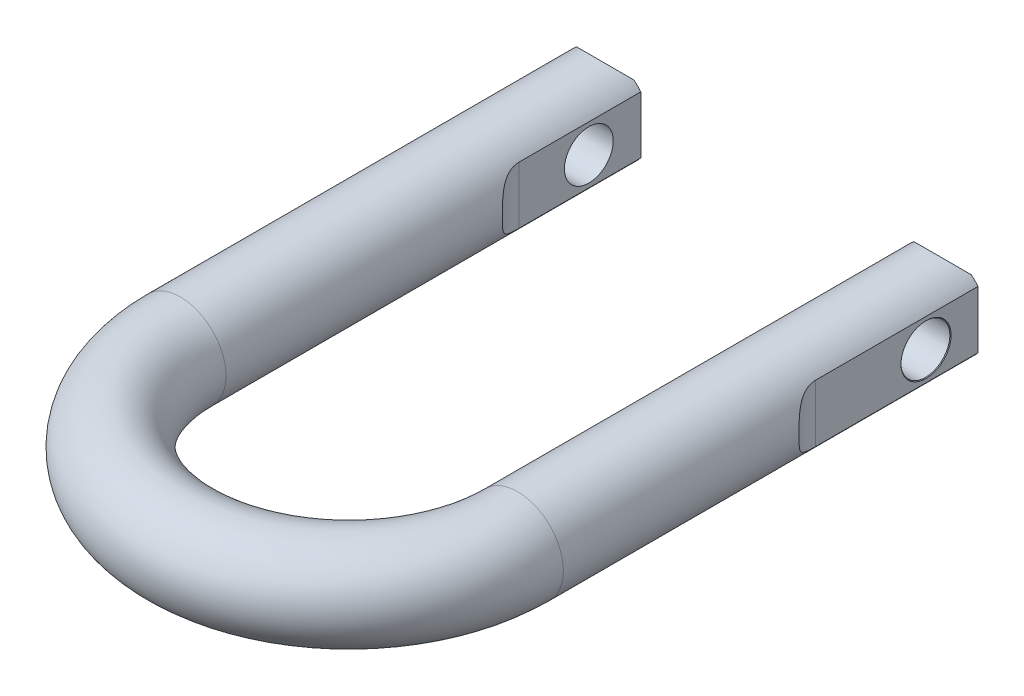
ISO-10303-21;
HEADER;
FILE_DESCRIPTION(('STEP AP214'),'2;1');
FILE_NAME('part.step','',(''),(''),'','','');
FILE_SCHEMA(('AUTOMOTIVE_DESIGN { 1 0 10303 214 1 1 1 1 }'));
ENDSEC;
DATA;
#1=APPLICATION_CONTEXT('core data for automotive mechanical design processes');
#2=APPLICATION_PROTOCOL_DEFINITION('international standard','automotive_design',2000,#1);
#3=PRODUCT_CONTEXT('',#1,'mechanical');
#4=PRODUCT('Part','Part','',(#3));
#5=PRODUCT_RELATED_PRODUCT_CATEGORY('part','',(#4));
#6=PRODUCT_DEFINITION_FORMATION('','',#4);
#7=PRODUCT_DEFINITION_CONTEXT('part definition',#1,'design');
#8=PRODUCT_DEFINITION('design','',#6,#7);
#9=PRODUCT_DEFINITION_SHAPE('','',#8);
#10=(LENGTH_UNIT() NAMED_UNIT(*) SI_UNIT(.MILLI.,.METRE.));
#11=(NAMED_UNIT(*) PLANE_ANGLE_UNIT() SI_UNIT($,.RADIAN.));
#12=(NAMED_UNIT(*) SI_UNIT($,.STERADIAN.) SOLID_ANGLE_UNIT());
#13=UNCERTAINTY_MEASURE_WITH_UNIT(LENGTH_MEASURE(1.E-05),#10,'distance_accuracy_value','');
#14=(GEOMETRIC_REPRESENTATION_CONTEXT(3) GLOBAL_UNCERTAINTY_ASSIGNED_CONTEXT((#13)) GLOBAL_UNIT_ASSIGNED_CONTEXT((#10,
#11,#12)) REPRESENTATION_CONTEXT('',''));
#15=CARTESIAN_POINT('',(0.,0.,0.));
#16=DIRECTION('',(0.,0.,1.));
#17=DIRECTION('',(1.,0.,0.));
#18=AXIS2_PLACEMENT_3D('',#15,#16,#17);
#19=CARTESIAN_POINT('',(127.36576,0.,0.));
#20=DIRECTION('',(-1.,0.,0.));
#21=DIRECTION('',(0.,-1.,0.));
#22=AXIS2_PLACEMENT_3D('',#19,#20,#21);
#23=CYLINDRICAL_SURFACE('',#22,15.2781);
#24=CARTESIAN_POINT('',(83.312,0.,0.));
#25=DIRECTION('',(-1.,0.,0.));
#26=DIRECTION('',(0.,-1.,0.));
#27=AXIS2_PLACEMENT_3D('',#24,#25,#26);
#28=CIRCLE('',#27,15.2781);
#29=CARTESIAN_POINT('',(83.312,-15.2781,0.));
#30=VERTEX_POINT('',#29);
#31=EDGE_CURVE('E18',#30,#30,#28,.T.);
#32=ORIENTED_EDGE('',*,*,#31,.T.);
#33=EDGE_LOOP('',(#32));
#34=FACE_BOUND('',#33,.T.);
#35=CARTESIAN_POINT('',(127.36576,0.,0.));
#36=DIRECTION('',(-1.,0.,0.));
#37=DIRECTION('',(0.,-1.,0.));
#38=AXIS2_PLACEMENT_3D('',#35,#36,#37);
#39=CIRCLE('',#38,15.2781);
#40=CARTESIAN_POINT('',(127.36576,-15.2781,0.));
#41=VERTEX_POINT('',#40);
#42=EDGE_CURVE('E173',#41,#41,#39,.F.);
#43=ORIENTED_EDGE('',*,*,#42,.T.);
#44=EDGE_LOOP('',(#43));
#45=FACE_BOUND('',#44,.T.);
#46=ADVANCED_FACE('F14',(#34,#45),#23,.F.);
#47=CARTESIAN_POINT('',(127.36576,0.,0.));
#48=DIRECTION('',(1.,0.,0.));
#49=DIRECTION('',(0.,1.,0.));
#50=AXIS2_PLACEMENT_3D('',#47,#48,#49);
#51=CONICAL_SURFACE('',#50,15.2781,0.785398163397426);
#52=CARTESIAN_POINT('',(127.762000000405,0.,0.));
#53=DIRECTION('',(-1.,0.,0.));
#54=DIRECTION('',(0.,0.,1.));
#55=AXIS2_PLACEMENT_3D('',#52,#53,#54);
#56=CIRCLE('',#55,15.6743400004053);
#57=CARTESIAN_POINT('',(127.762000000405,0.,15.6743400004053));
#58=VERTEX_POINT('',#57);
#59=EDGE_CURVE('E275',#58,#58,#56,.T.);
#60=ORIENTED_EDGE('',*,*,#59,.F.);
#61=EDGE_LOOP('',(#60));
#62=FACE_BOUND('',#61,.T.);
#63=ORIENTED_EDGE('',*,*,#42,.F.);
#64=EDGE_LOOP('',(#63));
#65=FACE_BOUND('',#64,.T.);
#66=ADVANCED_FACE('F247',(#62,#65),#51,.F.);
#67=CARTESIAN_POINT('',(-83.312,0.,0.));
#68=DIRECTION('',(-1.,0.,0.));
#69=DIRECTION('',(0.,-1.,0.));
#70=AXIS2_PLACEMENT_3D('',#67,#68,#69);
#71=CYLINDRICAL_SURFACE('',#70,15.2781);
#72=CARTESIAN_POINT('',(-83.312,0.,0.));
#73=DIRECTION('',(-1.,0.,0.));
#74=DIRECTION('',(0.,-1.,0.));
#75=AXIS2_PLACEMENT_3D('',#72,#73,#74);
#76=CIRCLE('',#75,15.2781);
#77=CARTESIAN_POINT('',(-83.312,-15.2781,0.));
#78=VERTEX_POINT('',#77);
#79=EDGE_CURVE('E129',#78,#78,#76,.F.);
#80=ORIENTED_EDGE('',*,*,#79,.T.);
#81=EDGE_LOOP('',(#80));
#82=FACE_BOUND('',#81,.T.);
#83=CARTESIAN_POINT('',(-127.36576,0.,0.));
#84=DIRECTION('',(-1.,0.,0.));
#85=DIRECTION('',(0.,-1.,0.));
#86=AXIS2_PLACEMENT_3D('',#83,#84,#85);
#87=CIRCLE('',#86,15.2781);
#88=CARTESIAN_POINT('',(-127.36576,-15.2781,0.));
#89=VERTEX_POINT('',#88);
#90=EDGE_CURVE('E161',#89,#89,#87,.F.);
#91=ORIENTED_EDGE('',*,*,#90,.F.);
#92=EDGE_LOOP('',(#91));
#93=FACE_BOUND('',#92,.T.);
#94=ADVANCED_FACE('F254',(#82,#93),#71,.F.);
#95=CARTESIAN_POINT('',(-127.36576,0.,0.));
#96=DIRECTION('',(-1.,0.,0.));
#97=DIRECTION('',(0.,-1.,0.));
#98=AXIS2_PLACEMENT_3D('',#95,#96,#97);
#99=CONICAL_SURFACE('',#98,15.2781,0.785398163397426);
#100=CARTESIAN_POINT('',(-127.762000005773,0.,0.));
#101=DIRECTION('',(1.,0.,0.));
#102=DIRECTION('',(0.,0.,-1.));
#103=AXIS2_PLACEMENT_3D('',#100,#101,#102);
#104=CIRCLE('',#103,15.6743400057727);
#105=CARTESIAN_POINT('',(-127.762000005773,0.,-15.6743400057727));
#106=VERTEX_POINT('',#105);
#107=EDGE_CURVE('E176',#106,#106,#104,.T.);
#108=ORIENTED_EDGE('',*,*,#107,.F.);
#109=EDGE_LOOP('',(#108));
#110=FACE_BOUND('',#109,.T.);
#111=ORIENTED_EDGE('',*,*,#90,.T.);
#112=EDGE_LOOP('',(#111));
#113=FACE_BOUND('',#112,.T.);
#114=ADVANCED_FACE('F227',(#110,#113),#99,.F.);
#115=CARTESIAN_POINT('',(123.7447884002,22.225,-32.512));
#116=DIRECTION('',(0.,-0.707106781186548,0.707106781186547));
#117=DIRECTION('',(0.,0.707106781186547,0.707106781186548));
#118=AXIS2_PLACEMENT_3D('',#115,#116,#117);
#119=PLANE('',#118);
#120=DIRECTION('',(1.,0.,0.));
#121=VECTOR('',#120,1.);
#122=CARTESIAN_POINT('',(105.537,22.225,-32.512));
#123=LINE('',#122,#121);
#124=CARTESIAN_POINT('',(87.6082377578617,22.225,-32.512));
#125=VERTEX_POINT('',#124);
#126=CARTESIAN_POINT('',(123.529262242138,22.225,-32.512));
#127=VERTEX_POINT('',#126);
#128=EDGE_CURVE('E101',#125,#127,#123,.T.);
#129=ORIENTED_EDGE('',*,*,#128,.F.);
#130=CARTESIAN_POINT('',(105.56875,0.,-54.737));
#131=DIRECTION('',(0.,-0.707106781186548,0.707106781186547));
#132=DIRECTION('',(0.,-0.707106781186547,-0.707106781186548));
#133=AXIS2_PLACEMENT_3D('',#130,#131,#132);
#134=ELLIPSE('',#133,40.4111525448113,28.575);
#135=EDGE_CURVE('E105',#125,#127,#134,.F.);
#136=ORIENTED_EDGE('',*,*,#135,.T.);
#137=EDGE_LOOP('',(#129,#136));
#138=FACE_BOUND('',#137,.T.);
#139=ADVANCED_FACE('F103',(#138),#119,.F.);
#140=CARTESIAN_POINT('',(153.162,-18.2157267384,69.088));
#141=DIRECTION('',(0.,1.,0.));
#142=DIRECTION('',(-1.,0.,0.));
#143=AXIS2_PLACEMENT_3D('',#140,#141,#142);
#144=CYLINDRICAL_SURFACE('',#143,25.4);
#145=CARTESIAN_POINT('',(127.76200000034,17.9997299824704,69.0879999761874));
#146=CARTESIAN_POINT('',(127.761997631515,17.9997270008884,69.3125340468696));
#147=CARTESIAN_POINT('',(127.764978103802,17.9960588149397,69.5370409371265));
#148=CARTESIAN_POINT('',(127.776875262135,17.9813771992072,69.9856525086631));
#149=CARTESIAN_POINT('',(127.785791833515,17.9703639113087,70.2097571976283));
#150=CARTESIAN_POINT('',(127.821397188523,17.9262894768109,70.8808747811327));
#151=CARTESIAN_POINT('',(127.856941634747,17.8821937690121,71.3267762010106));
#152=CARTESIAN_POINT('',(127.950918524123,17.7644249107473,72.2120230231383));
#153=CARTESIAN_POINT('',(128.009344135,17.6907605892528,72.651370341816));
#154=CARTESIAN_POINT('',(128.147878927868,17.5136004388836,73.520534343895));
#155=CARTESIAN_POINT('',(128.22798741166,17.4101055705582,73.9503513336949));
#156=CARTESIAN_POINT('',(128.408285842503,17.1728979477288,74.7977729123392));
#157=CARTESIAN_POINT('',(128.50849750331,17.0391524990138,75.2153637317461));
#158=CARTESIAN_POINT('',(128.726737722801,16.7413345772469,76.0347776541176));
#159=CARTESIAN_POINT('',(128.844766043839,16.5772625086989,76.4366009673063));
#160=CARTESIAN_POINT('',(129.095861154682,16.2189230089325,77.2212993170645));
#161=CARTESIAN_POINT('',(129.228917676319,16.0246761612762,77.6041870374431));
#162=CARTESIAN_POINT('',(129.50700729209,15.6062017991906,78.3486269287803));
#163=CARTESIAN_POINT('',(129.652040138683,15.3819749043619,78.7101795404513));
#164=CARTESIAN_POINT('',(129.948202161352,14.9080421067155,79.40398744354));
#165=CARTESIAN_POINT('',(130.099195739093,14.6588040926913,79.7366204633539));
#166=CARTESIAN_POINT('',(130.405875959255,14.1329545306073,80.3771508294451));
#167=CARTESIAN_POINT('',(130.561562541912,13.856343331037,80.6850484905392));
#168=CARTESIAN_POINT('',(130.874028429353,13.2771146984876,81.2747849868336));
#169=CARTESIAN_POINT('',(131.030807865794,12.9744940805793,81.5566206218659));
#170=CARTESIAN_POINT('',(131.341873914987,12.3450368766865,82.0933195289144));
#171=CARTESIAN_POINT('',(131.49616048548,12.0181998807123,82.3481823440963));
#172=CARTESIAN_POINT('',(131.801147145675,11.3372491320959,82.8341828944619));
#173=CARTESIAN_POINT('',(131.951757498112,10.9827971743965,83.0649027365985));
#174=CARTESIAN_POINT('',(132.243679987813,10.2534400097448,83.498140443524));
#175=CARTESIAN_POINT('',(132.38499199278,9.87853451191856,83.7006579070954));
#176=CARTESIAN_POINT('',(132.655560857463,9.11049899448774,84.0779938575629));
#177=CARTESIAN_POINT('',(132.78480866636,8.71735561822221,84.2527916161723));
#178=CARTESIAN_POINT('',(133.028688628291,7.91567837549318,84.5751115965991));
#179=CARTESIAN_POINT('',(133.143320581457,7.50714429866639,84.7226334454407));
#180=CARTESIAN_POINT('',(133.363630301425,6.64726701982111,85.0008348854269));
#181=CARTESIAN_POINT('',(133.46806429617,6.19496244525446,85.1295298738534));
#182=CARTESIAN_POINT('',(133.655856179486,5.27862558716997,85.3573624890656));
#183=CARTESIAN_POINT('',(133.739210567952,4.81459137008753,85.4564952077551));
#184=CARTESIAN_POINT('',(133.883243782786,3.87864924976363,85.6258926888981));
#185=CARTESIAN_POINT('',(133.943959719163,3.40675556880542,85.6962047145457));
#186=CARTESIAN_POINT('',(134.041883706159,2.45740250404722,85.8088479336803));
#187=CARTESIAN_POINT('',(134.079102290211,1.97994571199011,85.8511916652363));
#188=CARTESIAN_POINT('',(134.117429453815,1.25144697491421,85.8946850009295));
#189=CARTESIAN_POINT('',(134.12729504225,1.00139567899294,85.9058509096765));
#190=CARTESIAN_POINT('',(134.140456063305,0.500905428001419,85.9207348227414));
#191=CARTESIAN_POINT('',(134.143751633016,0.250466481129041,85.9244529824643));
#192=CARTESIAN_POINT('',(134.143746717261,-0.503635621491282,85.9244545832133));
#193=CARTESIAN_POINT('',(134.1304119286,-1.00738260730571,85.9094242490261));
#194=CARTESIAN_POINT('',(134.07727904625,-2.01185607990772,85.849115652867));
#195=CARTESIAN_POINT('',(134.03746789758,-2.51258095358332,85.8038224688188));
#196=CARTESIAN_POINT('',(133.931957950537,-3.50860707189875,85.6823357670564));
#197=CARTESIAN_POINT('',(133.866205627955,-4.00389491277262,85.6060783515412));
#198=CARTESIAN_POINT('',(133.710027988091,-4.98453363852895,85.4218713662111));
#199=CARTESIAN_POINT('',(133.619605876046,-5.46988580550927,85.3139259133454));
#200=CARTESIAN_POINT('',(133.415659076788,-6.42811293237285,85.0651065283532));
#201=CARTESIAN_POINT('',(133.302092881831,-6.90096372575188,84.9241733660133));
#202=CARTESIAN_POINT('',(133.054341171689,-7.82967855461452,84.6083837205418));
#203=CARTESIAN_POINT('',(132.920154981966,-8.28554203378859,84.4335261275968));
#204=CARTESIAN_POINT('',(132.634336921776,-9.17623027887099,84.0490277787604));
#205=CARTESIAN_POINT('',(132.482719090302,-9.61107158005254,83.8394149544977));
#206=CARTESIAN_POINT('',(132.165693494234,-10.4564328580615,83.3845697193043));
#207=CARTESIAN_POINT('',(132.000286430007,-10.8669540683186,83.1393391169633));
#208=CARTESIAN_POINT('',(131.664954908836,-11.6487968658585,82.620540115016));
#209=CARTESIAN_POINT('',(131.495296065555,-12.0209050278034,82.3479861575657));
#210=CARTESIAN_POINT('',(131.151631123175,-12.7359407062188,81.7693574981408));
#211=CARTESIAN_POINT('',(130.977625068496,-13.078868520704,81.4632831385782));
#212=CARTESIAN_POINT('',(130.630199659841,-13.7328606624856,80.8188088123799));
#213=CARTESIAN_POINT('',(130.456780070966,-14.0439397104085,80.4804239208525));
#214=CARTESIAN_POINT('',(130.115418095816,-14.6324114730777,79.7729995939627));
#215=CARTESIAN_POINT('',(129.947475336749,-14.9098064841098,79.4039622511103));
#216=CARTESIAN_POINT('',(129.634827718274,-15.408902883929,78.6681391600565));
#217=CARTESIAN_POINT('',(129.489336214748,-15.6332764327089,78.3034957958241));
#218=CARTESIAN_POINT('',(129.210624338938,-16.0516544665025,77.5527436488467));
#219=CARTESIAN_POINT('',(129.077403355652,-16.2456604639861,77.1666359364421));
#220=CARTESIAN_POINT('',(128.826331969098,-16.6031101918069,76.3754946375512));
#221=CARTESIAN_POINT('',(128.708488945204,-16.7665392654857,75.9704520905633));
#222=CARTESIAN_POINT('',(128.490963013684,-17.0627244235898,75.1445888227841));
#223=CARTESIAN_POINT('',(128.391280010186,-17.1954806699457,74.7237681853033));
#224=CARTESIAN_POINT('',(128.214243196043,-17.427941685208,73.8787919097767));
#225=CARTESIAN_POINT('',(128.136450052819,-17.5283037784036,73.4549088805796));
#226=CARTESIAN_POINT('',(128.001958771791,-17.7001038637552,72.598047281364));
#227=CARTESIAN_POINT('',(127.945260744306,-17.771541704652,72.1650686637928));
#228=CARTESIAN_POINT('',(127.854082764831,-17.8857469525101,71.2928899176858));
#229=CARTESIAN_POINT('',(127.819607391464,-17.928508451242,70.8536885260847));
#230=CARTESIAN_POINT('',(127.785074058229,-17.9712507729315,70.1927154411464));
#231=CARTESIAN_POINT('',(127.776426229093,-17.9819315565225,69.9720052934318));
#232=CARTESIAN_POINT('',(127.764888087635,-17.9961697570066,69.5302053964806));
#233=CARTESIAN_POINT('',(127.761997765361,-17.999727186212,69.3091156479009));
#234=CARTESIAN_POINT('',(127.762,-17.9997299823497,69.0879999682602));
#235=B_SPLINE_CURVE_WITH_KNOTS('',3,(#145,#146,#147,#148,#149,#150,#151,#152,#153,#154,#155,
#156,#157,#158,#159,#160,#161,#162,#163,#164,#165,#166,#167,#168,#169,#170,#171,#172,#173,#174,
#175,#176,#177,#178,#179,#180,#181,#182,#183,#184,#185,#186,#187,#188,#189,#190,#191,#192,#193,
#194,#195,#196,#197,#198,#199,#200,#201,#202,#203,#204,#205,#206,#207,#208,#209,#210,#211,#212,
#213,#214,#215,#216,#217,#218,#219,#220,#221,#222,#223,#224,#225,#226,#227,#228,#229,#230,#231,
#232,#233,#234),.UNSPECIFIED.,.F.,.F.,(4,2,2,2,2,2,2,2,2,2,2,2,2,2,2,2,2,2,2,2,2,2,2,2,2,2,2,2,
2,2,2,2,2,2,2,2,2,2,2,2,2,2,2,2,4),(0.,0.673498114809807,1.34698322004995,2.69369922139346,
4.04001340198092,5.38628423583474,6.73401710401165,8.08173199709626,9.42853155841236,
10.7753032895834,12.1004103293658,13.4255005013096,14.7507531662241,16.0760282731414,
17.4213796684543,18.7667502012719,20.1131220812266,21.459512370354,22.9030973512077,
24.3469218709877,25.7883690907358,27.2291696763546,27.9804811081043,28.7317768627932,
30.2424751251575,31.7539188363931,33.2684975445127,34.7828795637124,36.3000018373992,
37.8171737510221,39.3331322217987,40.8490137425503,42.321419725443,43.7938106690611,
45.2655179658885,46.7371248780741,48.0920268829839,49.446861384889,50.8023436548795,
52.1578187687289,53.4837498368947,54.8096878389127,56.1358989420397,56.7991477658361,
57.4623954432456),.UNSPECIFIED.);
#236=CARTESIAN_POINT('',(127.761999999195,17.9997299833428,69.088));
#237=VERTEX_POINT('',#236);
#238=CARTESIAN_POINT('',(127.762000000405,-17.9997299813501,69.087999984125));
#239=VERTEX_POINT('',#238);
#240=EDGE_CURVE('E158',#237,#239,#235,.T.);
#241=ORIENTED_EDGE('',*,*,#240,.T.);
#242=DIRECTION('',(0.,1.,0.));
#243=VECTOR('',#242,1.);
#244=CARTESIAN_POINT('',(127.762,0.,69.088));
#245=LINE('',#244,#243);
#246=EDGE_CURVE('E110',#239,#237,#245,.T.);
#247=ORIENTED_EDGE('',*,*,#246,.T.);
#248=EDGE_LOOP('',(#241,#247));
#249=FACE_BOUND('',#248,.T.);
#250=ADVANCED_FACE('F221',(#249),#144,.F.);
#251=CARTESIAN_POINT('',(127.762,-17.9997299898,-32.512));
#252=DIRECTION('',(-1.,0.,0.));
#253=DIRECTION('',(0.,0.,1.));
#254=AXIS2_PLACEMENT_3D('',#251,#252,#253);
#255=PLANE('',#254);
#256=DIRECTION('',(0.,0.,-1.));
#257=VECTOR('',#256,1.);
#258=CARTESIAN_POINT('',(127.761999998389,17.9997299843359,100.441125));
#259=LINE('',#258,#257);
#260=CARTESIAN_POINT('',(127.761999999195,17.9997299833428,-32.512));
#261=VERTEX_POINT('',#260);
#262=EDGE_CURVE('E126',#261,#237,#259,.F.);
#263=ORIENTED_EDGE('',*,*,#262,.T.);
#264=ORIENTED_EDGE('',*,*,#246,.F.);
#265=DIRECTION('',(0.,0.,1.));
#266=VECTOR('',#265,1.);
#267=CARTESIAN_POINT('',(127.762000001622,-17.9997299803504,100.441125));
#268=LINE('',#267,#266);
#269=CARTESIAN_POINT('',(127.762000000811,-17.9997299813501,-32.512));
#270=VERTEX_POINT('',#269);
#271=EDGE_CURVE('E155',#239,#270,#268,.F.);
#272=ORIENTED_EDGE('',*,*,#271,.T.);
#273=DIRECTION('',(0.,-1.,0.));
#274=VECTOR('',#273,1.);
#275=CARTESIAN_POINT('',(127.762,0.,-32.512));
#276=LINE('',#275,#274);
#277=EDGE_CURVE('E109',#261,#270,#276,.T.);
#278=ORIENTED_EDGE('',*,*,#277,.F.);
#279=EDGE_LOOP('',(#263,#264,#272,#278));
#280=FACE_BOUND('',#279,.T.);
#281=ORIENTED_EDGE('',*,*,#59,.T.);
#282=EDGE_LOOP('',(#281));
#283=FACE_BOUND('',#282,.T.);
#284=ADVANCED_FACE('F225',(#280,#283),#255,.F.);
#285=CARTESIAN_POINT('',(123.7447884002,-28.6131,-26.1239));
#286=DIRECTION('',(0.,0.707106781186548,0.707106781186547));
#287=DIRECTION('',(0.,0.707106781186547,-0.707106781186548));
#288=AXIS2_PLACEMENT_3D('',#285,#286,#287);
#289=PLANE('',#288);
#290=DIRECTION('',(-1.,0.,0.));
#291=VECTOR('',#290,1.);
#292=CARTESIAN_POINT('',(105.537,-22.225,-32.512));
#293=LINE('',#292,#291);
#294=CARTESIAN_POINT('',(123.529262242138,-22.225,-32.512));
#295=VERTEX_POINT('',#294);
#296=CARTESIAN_POINT('',(87.6082377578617,-22.225,-32.512));
#297=VERTEX_POINT('',#296);
#298=EDGE_CURVE('E154',#295,#297,#293,.T.);
#299=ORIENTED_EDGE('',*,*,#298,.F.);
#300=CARTESIAN_POINT('',(105.56875,0.,-54.737));
#301=DIRECTION('',(0.,0.707106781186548,0.707106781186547));
#302=DIRECTION('',(0.,0.707106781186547,-0.707106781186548));
#303=AXIS2_PLACEMENT_3D('',#300,#301,#302);
#304=ELLIPSE('',#303,40.4111525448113,28.575);
#305=EDGE_CURVE('E481',#295,#297,#304,.F.);
#306=ORIENTED_EDGE('',*,*,#305,.T.);
#307=EDGE_LOOP('',(#299,#306));
#308=FACE_BOUND('',#307,.T.);
#309=ADVANCED_FACE('F243',(#308),#289,.F.);
#310=CARTESIAN_POINT('',(127.762,-22.225,-32.512));
#311=DIRECTION('',(0.,0.,-1.));
#312=DIRECTION('',(-1.,0.,0.));
#313=AXIS2_PLACEMENT_3D('',#310,#311,#312);
#314=PLANE('',#313);
#315=DIRECTION('',(0.,1.,0.));
#316=VECTOR('',#315,1.);
#317=CARTESIAN_POINT('',(83.312,0.,-32.512));
#318=LINE('',#317,#316);
#319=CARTESIAN_POINT('',(83.3119999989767,-17.921152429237,-32.512));
#320=VERTEX_POINT('',#319);
#321=CARTESIAN_POINT('',(83.3119999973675,17.9211524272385,-32.512));
#322=VERTEX_POINT('',#321);
#323=EDGE_CURVE('E116',#320,#322,#318,.T.);
#324=ORIENTED_EDGE('',*,*,#323,.T.);
#325=CARTESIAN_POINT('',(105.56875,0.,-32.512));
#326=DIRECTION('',(0.,0.,-1.));
#327=DIRECTION('',(0.,-1.,0.));
#328=AXIS2_PLACEMENT_3D('',#325,#326,#327);
#329=CIRCLE('',#328,28.575);
#330=EDGE_CURVE('E113',#322,#125,#329,.T.);
#331=ORIENTED_EDGE('',*,*,#330,.T.);
#332=ORIENTED_EDGE('',*,*,#128,.T.);
#333=CARTESIAN_POINT('',(105.56875,0.,-32.512));
#334=DIRECTION('',(0.,0.,-1.));
#335=DIRECTION('',(0.,-1.,0.));
#336=AXIS2_PLACEMENT_3D('',#333,#334,#335);
#337=CIRCLE('',#336,28.575);
#338=EDGE_CURVE('E124',#127,#261,#337,.T.);
#339=ORIENTED_EDGE('',*,*,#338,.T.);
#340=ORIENTED_EDGE('',*,*,#277,.T.);
#341=CARTESIAN_POINT('',(105.56875,0.,-32.512));
#342=DIRECTION('',(0.,0.,-1.));
#343=DIRECTION('',(0.,-1.,0.));
#344=AXIS2_PLACEMENT_3D('',#341,#342,#343);
#345=CIRCLE('',#344,28.575);
#346=EDGE_CURVE('E157',#270,#295,#345,.T.);
#347=ORIENTED_EDGE('',*,*,#346,.T.);
#348=ORIENTED_EDGE('',*,*,#298,.T.);
#349=CARTESIAN_POINT('',(105.56875,0.,-32.512));
#350=DIRECTION('',(0.,0.,-1.));
#351=DIRECTION('',(0.,-1.,0.));
#352=AXIS2_PLACEMENT_3D('',#349,#350,#351);
#353=CIRCLE('',#352,28.575);
#354=EDGE_CURVE('E152',#297,#320,#353,.T.);
#355=ORIENTED_EDGE('',*,*,#354,.T.);
#356=EDGE_LOOP('',(#324,#331,#332,#339,#340,#347,#348,#355));
#357=FACE_BOUND('',#356,.T.);
#358=ADVANCED_FACE('F114',(#357),#314,.T.);
#359=CARTESIAN_POINT('',(57.912,-18.1362062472,43.688));
#360=DIRECTION('',(0.,1.,0.));
#361=DIRECTION('',(0.,0.,-1.));
#362=AXIS2_PLACEMENT_3D('',#359,#360,#361);
#363=CYLINDRICAL_SURFACE('',#362,25.4);
#364=CARTESIAN_POINT('',(83.3120000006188,-17.9211524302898,43.6879999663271));
#365=CARTESIAN_POINT('',(83.3120023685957,-17.9211494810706,43.9116905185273));
#366=CARTESIAN_POINT('',(83.3090442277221,-17.9174823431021,44.1353539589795));
#367=CARTESIAN_POINT('',(83.2972363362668,-17.9028051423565,44.5822796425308));
#368=CARTESIAN_POINT('',(83.2883866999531,-17.8917952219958,44.8055418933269));
#369=CARTESIAN_POINT('',(83.2530489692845,-17.847734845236,45.4741346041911));
#370=CARTESIAN_POINT('',(83.2177720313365,-17.8036537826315,45.9183564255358));
#371=CARTESIAN_POINT('',(83.1245071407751,-17.6859318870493,46.80025243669));
#372=CARTESIAN_POINT('',(83.0665264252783,-17.6123004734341,47.2379286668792));
#373=CARTESIAN_POINT('',(82.9290545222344,-17.4352335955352,48.1037769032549));
#374=CARTESIAN_POINT('',(82.8495640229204,-17.3317990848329,48.5319492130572));
#375=CARTESIAN_POINT('',(82.6706698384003,-17.0947536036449,49.376113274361));
#376=CARTESIAN_POINT('',(82.5712447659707,-16.9611102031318,49.7920913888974));
#377=CARTESIAN_POINT('',(82.3547357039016,-16.6635528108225,50.6083285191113));
#378=CARTESIAN_POINT('',(82.2376519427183,-16.4996392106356,51.0085877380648));
#379=CARTESIAN_POINT('',(81.9885891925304,-16.1416887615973,51.7902217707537));
#380=CARTESIAN_POINT('',(81.8566202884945,-15.9476722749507,52.171609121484));
#381=CARTESIAN_POINT('',(81.5808324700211,-15.5297480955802,52.9131208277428));
#382=CARTESIAN_POINT('',(81.4370138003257,-15.3058410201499,53.2732456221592));
#383=CARTESIAN_POINT('',(81.1433814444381,-14.8326742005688,53.9642633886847));
#384=CARTESIAN_POINT('',(80.993702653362,-14.5838840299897,54.2955354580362));
#385=CARTESIAN_POINT('',(80.6897289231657,-14.0590490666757,54.9334399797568));
#386=CARTESIAN_POINT('',(80.5354340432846,-13.7830046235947,55.24007274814));
#387=CARTESIAN_POINT('',(80.2257998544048,-13.2050355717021,55.8273816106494));
#388=CARTESIAN_POINT('',(80.0704604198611,-12.9031077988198,56.1080545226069));
#389=CARTESIAN_POINT('',(79.762292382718,-12.2751648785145,56.6425327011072));
#390=CARTESIAN_POINT('',(79.6094638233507,-11.949149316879,56.8963375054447));
#391=CARTESIAN_POINT('',(79.3073324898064,-11.2698222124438,57.3804231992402));
#392=CARTESIAN_POINT('',(79.1581220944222,-10.9161638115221,57.6102746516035));
#393=CARTESIAN_POINT('',(78.8689683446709,-10.1885014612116,58.0418487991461));
#394=CARTESIAN_POINT('',(78.7290251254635,-9.81449721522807,58.2435710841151));
#395=CARTESIAN_POINT('',(78.4611407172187,-9.04836676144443,58.6193806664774));
#396=CARTESIAN_POINT('',(78.333208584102,-8.6562272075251,58.7934471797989));
#397=CARTESIAN_POINT('',(78.0918867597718,-7.85665493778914,59.1143568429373));
#398=CARTESIAN_POINT('',(77.9784972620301,-7.44922201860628,59.2611996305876));
#399=CARTESIAN_POINT('',(77.7606705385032,-6.59172644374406,59.5380327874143));
#400=CARTESIAN_POINT('',(77.6574700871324,-6.14070938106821,59.6660419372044));
#401=CARTESIAN_POINT('',(77.4720240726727,-5.22704245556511,59.8925329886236));
#402=CARTESIAN_POINT('',(77.389782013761,-4.76439066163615,59.9910099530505));
#403=CARTESIAN_POINT('',(77.2478373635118,-3.831305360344,60.159110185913));
#404=CARTESIAN_POINT('',(77.1880975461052,-3.3608860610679,60.2287811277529));
#405=CARTESIAN_POINT('',(77.091978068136,-2.41456130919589,60.3401435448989));
#406=CARTESIAN_POINT('',(77.0555878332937,-1.93865843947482,60.3818476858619));
#407=CARTESIAN_POINT('',(77.018695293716,-1.21833185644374,60.424023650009));
#408=CARTESIAN_POINT('',(77.0093450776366,-0.974887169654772,60.4346863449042));
#409=CARTESIAN_POINT('',(76.9968717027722,-0.487637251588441,60.448899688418));
#410=CARTESIAN_POINT('',(76.9937484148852,-0.243832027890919,60.4524504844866));
#411=CARTESIAN_POINT('',(76.9937532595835,0.501409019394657,60.4524520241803));
#412=CARTESIAN_POINT('',(77.0069705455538,1.00293137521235,60.4374400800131));
#413=CARTESIAN_POINT('',(77.059634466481,2.00297039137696,60.3772076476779));
#414=CARTESIAN_POINT('',(77.099094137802,2.50148543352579,60.3319721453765));
#415=CARTESIAN_POINT('',(77.2036702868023,3.49312322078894,60.210647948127));
#416=CARTESIAN_POINT('',(77.2688400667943,3.98623256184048,60.1344951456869));
#417=CARTESIAN_POINT('',(77.4236283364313,4.96256110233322,59.9505580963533));
#418=CARTESIAN_POINT('',(77.5132436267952,5.44578158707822,59.8427779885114));
#419=CARTESIAN_POINT('',(77.7153594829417,6.3997977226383,59.5943706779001));
#420=CARTESIAN_POINT('',(77.8279007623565,6.87056956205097,59.4536849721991));
#421=CARTESIAN_POINT('',(78.0734029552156,7.79521102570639,59.1384923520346));
#422=CARTESIAN_POINT('',(78.2063645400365,8.2490800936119,58.9639843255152));
#423=CARTESIAN_POINT('',(78.489557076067,9.13588591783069,58.5803106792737));
#424=CARTESIAN_POINT('',(78.6397741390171,9.56883911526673,58.3711728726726));
#425=CARTESIAN_POINT('',(78.9538508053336,10.410548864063,57.9174270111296));
#426=CARTESIAN_POINT('',(79.117709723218,10.8193066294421,57.6728207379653));
#427=CARTESIAN_POINT('',(79.4499609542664,11.5980011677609,57.1552957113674));
#428=CARTESIAN_POINT('',(79.6180950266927,11.9687077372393,56.8833701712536));
#429=CARTESIAN_POINT('',(79.9586496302,12.6810591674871,56.3061405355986));
#430=CARTESIAN_POINT('',(80.1310701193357,13.0227043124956,56.0008367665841));
#431=CARTESIAN_POINT('',(80.4753038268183,13.6742580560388,55.3580526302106));
#432=CARTESIAN_POINT('',(80.647117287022,13.9841811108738,55.0205870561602));
#433=CARTESIAN_POINT('',(80.9852849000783,14.570464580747,54.3151554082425));
#434=CARTESIAN_POINT('',(81.151639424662,14.8468272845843,53.947191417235));
#435=CARTESIAN_POINT('',(81.4613378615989,15.344127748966,53.2134660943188));
#436=CARTESIAN_POINT('',(81.6054613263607,15.5677195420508,52.8498283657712));
#437=CARTESIAN_POINT('',(81.8815065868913,15.9846067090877,52.1011962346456));
#438=CARTESIAN_POINT('',(82.013428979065,16.1779035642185,51.7162028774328));
#439=CARTESIAN_POINT('',(82.2619932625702,16.5339928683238,50.9273995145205));
#440=CARTESIAN_POINT('',(82.3786280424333,16.6967711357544,50.5235808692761));
#441=CARTESIAN_POINT('',(82.5938504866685,16.9917030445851,49.7002616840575));
#442=CARTESIAN_POINT('',(82.6924382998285,17.1238569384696,49.2807612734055));
#443=CARTESIAN_POINT('',(82.8670483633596,17.3546467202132,48.4403581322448));
#444=CARTESIAN_POINT('',(82.943594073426,17.4540699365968,48.0197799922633));
#445=CARTESIAN_POINT('',(83.075923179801,17.6242728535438,47.169673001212));
#446=CARTESIAN_POINT('',(83.1317065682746,17.6950525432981,46.7401441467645));
#447=CARTESIAN_POINT('',(83.2214103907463,17.8082083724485,45.8749721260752));
#448=CARTESIAN_POINT('',(83.2553268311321,17.8505793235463,45.4393278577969));
#449=CARTESIAN_POINT('',(83.2893002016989,17.8929320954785,44.783723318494));
#450=CARTESIAN_POINT('',(83.2978077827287,17.9035157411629,44.5648079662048));
#451=CARTESIAN_POINT('',(83.3091587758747,17.9176245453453,44.1266035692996));
#452=CARTESIAN_POINT('',(83.3120021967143,17.9211497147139,43.9073145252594));
#453=CARTESIAN_POINT('',(83.312,17.921152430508,43.6879999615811));
#454=B_SPLINE_CURVE_WITH_KNOTS('',3,(#364,#365,#366,#367,#368,#369,#370,#371,#372,#373,#374,
#375,#376,#377,#378,#379,#380,#381,#382,#383,#384,#385,#386,#387,#388,#389,#390,#391,#392,#393,
#394,#395,#396,#397,#398,#399,#400,#401,#402,#403,#404,#405,#406,#407,#408,#409,#410,#411,#412,
#413,#414,#415,#416,#417,#418,#419,#420,#421,#422,#423,#424,#425,#426,#427,#428,#429,#430,#431,
#432,#433,#434,#435,#436,#437,#438,#439,#440,#441,#442,#443,#444,#445,#446,#447,#448,#449,#450,
#451,#452,#453),.UNSPECIFIED.,.F.,.F.,(4,2,2,2,2,2,2,2,2,2,2,2,2,2,2,2,2,2,2,2,2,2,2,2,2,2,2,2,
2,2,2,2,2,2,2,2,2,2,2,2,2,2,2,2,4),(0.,0.67096782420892,1.34192263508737,2.68357687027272,
4.02480378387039,5.36598778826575,6.7086184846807,8.05123181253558,9.39294089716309,
10.7346222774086,12.05456438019,13.3744895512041,14.6945763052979,16.0146857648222,
17.3554182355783,18.6961702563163,20.0379251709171,21.3796979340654,22.8183116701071,
24.2571657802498,25.6936289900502,27.1294412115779,27.8608535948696,28.5922508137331,
30.0962745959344,31.6010460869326,33.1089538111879,34.6166642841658,36.127075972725,
37.6375373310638,39.1467913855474,40.6559696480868,42.1225790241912,43.5891740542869,
45.0550977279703,46.5209213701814,47.8709148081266,49.2208422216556,50.5713953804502,
51.9219374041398,53.2371017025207,54.5522664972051,55.8676714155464,56.52551832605,
57.183364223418),.UNSPECIFIED.);
#455=CARTESIAN_POINT('',(83.3119999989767,-17.921152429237,43.6879999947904));
#456=VERTEX_POINT('',#455);
#457=CARTESIAN_POINT('',(83.3119999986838,17.9211524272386,43.6879999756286));
#458=VERTEX_POINT('',#457);
#459=EDGE_CURVE('E151',#456,#458,#454,.T.);
#460=ORIENTED_EDGE('',*,*,#459,.T.);
#461=DIRECTION('',(0.,1.,0.));
#462=VECTOR('',#461,1.);
#463=CARTESIAN_POINT('',(83.312,0.,43.6879999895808));
#464=LINE('',#463,#462);
#465=EDGE_CURVE('E138',#458,#456,#464,.F.);
#466=ORIENTED_EDGE('',*,*,#465,.T.);
#467=EDGE_LOOP('',(#460,#466));
#468=FACE_BOUND('',#467,.T.);
#469=ADVANCED_FACE('F229',(#468),#363,.F.);
#470=CARTESIAN_POINT('',(83.312,-17.9211524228,-32.512));
#471=DIRECTION('',(1.,0.,0.));
#472=DIRECTION('',(0.,1.,0.));
#473=AXIS2_PLACEMENT_3D('',#470,#471,#472);
#474=PLANE('',#473);
#475=ORIENTED_EDGE('',*,*,#31,.F.);
#476=EDGE_LOOP('',(#475));
#477=FACE_BOUND('',#476,.T.);
#478=ORIENTED_EDGE('',*,*,#465,.F.);
#479=DIRECTION('',(0.,0.,1.));
#480=VECTOR('',#479,1.);
#481=CARTESIAN_POINT('',(83.311999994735,17.9211524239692,100.441125));
#482=LINE('',#481,#480);
#483=EDGE_CURVE('E120',#458,#322,#482,.F.);
#484=ORIENTED_EDGE('',*,*,#483,.T.);
#485=ORIENTED_EDGE('',*,*,#323,.F.);
#486=DIRECTION('',(0.,0.,-1.));
#487=VECTOR('',#486,1.);
#488=CARTESIAN_POINT('',(83.3119999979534,-17.9211524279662,100.441125));
#489=LINE('',#488,#487);
#490=EDGE_CURVE('E149',#320,#456,#489,.F.);
#491=ORIENTED_EDGE('',*,*,#490,.T.);
#492=EDGE_LOOP('',(#478,#484,#485,#491));
#493=FACE_BOUND('',#492,.T.);
#494=ADVANCED_FACE('F232',(#477,#493),#474,.F.);
#495=CARTESIAN_POINT('',(-87.3927115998,22.225,-32.512));
#496=DIRECTION('',(0.,-0.707106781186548,0.707106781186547));
#497=DIRECTION('',(0.,0.707106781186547,0.707106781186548));
#498=AXIS2_PLACEMENT_3D('',#495,#496,#497);
#499=PLANE('',#498);
#500=CARTESIAN_POINT('',(-105.56875,0.,-54.737));
#501=DIRECTION('',(0.,-0.707106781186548,0.707106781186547));
#502=DIRECTION('',(0.,-0.707106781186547,-0.707106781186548));
#503=AXIS2_PLACEMENT_3D('',#500,#501,#502);
#504=ELLIPSE('',#503,40.4111525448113,28.575);
#505=CARTESIAN_POINT('',(-123.529262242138,22.225,-32.512));
#506=VERTEX_POINT('',#505);
#507=CARTESIAN_POINT('',(-87.6082377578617,22.225,-32.512));
#508=VERTEX_POINT('',#507);
#509=EDGE_CURVE('E304',#506,#508,#504,.F.);
#510=ORIENTED_EDGE('',*,*,#509,.T.);
#511=DIRECTION('',(-1.,0.,0.));
#512=VECTOR('',#511,1.);
#513=CARTESIAN_POINT('',(-105.537,22.225,-32.512));
#514=LINE('',#513,#512);
#515=EDGE_CURVE('E284',#508,#506,#514,.T.);
#516=ORIENTED_EDGE('',*,*,#515,.T.);
#517=EDGE_LOOP('',(#510,#516));
#518=FACE_BOUND('',#517,.T.);
#519=ADVANCED_FACE('F240',(#518),#499,.F.);
#520=CARTESIAN_POINT('',(-57.912,-18.1362062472,43.688));
#521=DIRECTION('',(0.,1.,0.));
#522=DIRECTION('',(0.,0.,-1.));
#523=AXIS2_PLACEMENT_3D('',#520,#521,#522);
#524=CYLINDRICAL_SURFACE('',#523,25.4);
#525=DIRECTION('',(0.,1.,0.));
#526=VECTOR('',#525,1.);
#527=CARTESIAN_POINT('',(-83.312,0.,43.688));
#528=LINE('',#527,#526);
#529=CARTESIAN_POINT('',(-83.3120000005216,-17.9211524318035,43.6879999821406));
#530=VERTEX_POINT('',#529);
#531=CARTESIAN_POINT('',(-83.3120000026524,17.921152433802,43.688));
#532=VERTEX_POINT('',#531);
#533=EDGE_CURVE('E132',#530,#532,#528,.T.);
#534=ORIENTED_EDGE('',*,*,#533,.T.);
#535=CARTESIAN_POINT('',(-83.312,17.921152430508,43.6879999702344));
#536=CARTESIAN_POINT('',(-83.3120023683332,17.9211494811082,43.9116905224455));
#537=CARTESIAN_POINT('',(-83.3090442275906,17.9174823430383,44.1353539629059));
#538=CARTESIAN_POINT('',(-83.2972363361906,17.902805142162,44.582279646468));
#539=CARTESIAN_POINT('',(-83.2883866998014,17.8917952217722,44.8055418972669));
#540=CARTESIAN_POINT('',(-83.2530489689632,17.8477348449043,45.474134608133));
#541=CARTESIAN_POINT('',(-83.2177720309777,17.8036537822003,45.9183564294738));
#542=CARTESIAN_POINT('',(-83.1245071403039,17.6859318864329,46.8002524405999));
#543=CARTESIAN_POINT('',(-83.0665264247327,17.6123004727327,47.2379286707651));
#544=CARTESIAN_POINT('',(-82.929054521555,17.4352335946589,48.1037769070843));
#545=CARTESIAN_POINT('',(-82.8495640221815,17.3317990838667,48.5319492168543));
#546=CARTESIAN_POINT('',(-82.6706698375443,17.0947536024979,49.3761132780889));
#547=CARTESIAN_POINT('',(-82.5712447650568,16.9611102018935,49.7920913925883));
#548=CARTESIAN_POINT('',(-82.3547357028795,16.6635528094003,50.6083285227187));
#549=CARTESIAN_POINT('',(-82.237651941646,16.4996392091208,51.0085877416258));
#550=CARTESIAN_POINT('',(-81.9885891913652,16.1416887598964,51.7902217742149));
#551=CARTESIAN_POINT('',(-81.8566202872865,15.9476722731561,52.1716091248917));
#552=CARTESIAN_POINT('',(-81.5808324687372,15.5297480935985,52.9131208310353));
#553=CARTESIAN_POINT('',(-81.4370137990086,15.3058410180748,53.2732456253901));
#554=CARTESIAN_POINT('',(-81.14338144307,14.8326741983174,53.9642633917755));
#555=CARTESIAN_POINT('',(-80.9937026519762,14.5838840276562,54.2955354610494));
#556=CARTESIAN_POINT('',(-80.6897289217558,14.0590490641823,54.9334399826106));
#557=CARTESIAN_POINT('',(-80.5354340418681,13.7830046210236,55.2400727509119));
#558=CARTESIAN_POINT('',(-80.2257998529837,13.2050355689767,55.8273816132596));
#559=CARTESIAN_POINT('',(-80.070460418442,12.9031077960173,56.1080545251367));
#560=CARTESIAN_POINT('',(-79.7622923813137,12.2751648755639,56.642532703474));
#561=CARTESIAN_POINT('',(-79.6094638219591,11.9491493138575,56.896337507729));
#562=CARTESIAN_POINT('',(-79.3073324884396,11.2698222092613,57.3804232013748));
#563=CARTESIAN_POINT('',(-79.158122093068,10.9161638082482,57.610274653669));
#564=CARTESIAN_POINT('',(-78.8689683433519,10.1885014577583,58.0418488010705));
#565=CARTESIAN_POINT('',(-78.7290251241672,9.81449721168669,58.2435710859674));
#566=CARTESIAN_POINT('',(-78.461140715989,9.04836675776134,58.6193806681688));
#567=CARTESIAN_POINT('',(-78.3332085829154,8.6562272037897,58.7934471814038));
#568=CARTESIAN_POINT('',(-78.0918867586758,7.85665493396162,59.1143568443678));
#569=CARTESIAN_POINT('',(-77.9784972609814,7.44922201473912,59.2611996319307));
#570=CARTESIAN_POINT('',(-77.7606705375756,6.59172643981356,59.5380327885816));
#571=CARTESIAN_POINT('',(-77.6574700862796,6.14070937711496,59.6660419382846));
#572=CARTESIAN_POINT('',(-77.4720240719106,5.22704245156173,59.8925329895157));
#573=CARTESIAN_POINT('',(-77.3897820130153,4.76439065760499,59.9910099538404));
#574=CARTESIAN_POINT('',(-77.2478373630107,3.83130535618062,60.1591101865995));
#575=CARTESIAN_POINT('',(-77.1880975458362,3.36088605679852,60.2287811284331));
#576=CARTESIAN_POINT('',(-77.0919780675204,2.41456130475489,60.3401435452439));
#577=CARTESIAN_POINT('',(-77.0555878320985,1.93865843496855,60.3818476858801));
#578=CARTESIAN_POINT('',(-77.0186952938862,1.21833185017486,60.4240236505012));
#579=CARTESIAN_POINT('',(-77.0093450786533,0.974887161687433,60.4346863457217));
#580=CARTESIAN_POINT('',(-76.9968717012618,0.487637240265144,60.4488996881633));
#581=CARTESIAN_POINT('',(-76.9937484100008,0.243832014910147,60.4524504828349));
#582=CARTESIAN_POINT('',(-76.9937532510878,-0.501409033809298,60.4524520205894));
#583=CARTESIAN_POINT('',(-77.0069705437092,-1.00293138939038,60.4374400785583));
#584=CARTESIAN_POINT('',(-77.0596344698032,-2.00297040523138,60.3772076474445));
#585=CARTESIAN_POINT('',(-77.0990941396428,-2.50148544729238,60.331972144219));
#586=CARTESIAN_POINT('',(-77.2036702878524,-3.49312323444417,60.2106479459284));
#587=CARTESIAN_POINT('',(-77.2688400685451,-3.98623257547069,60.1344951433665));
#588=CARTESIAN_POINT('',(-77.4236283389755,-4.96256111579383,59.95055809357));
#589=CARTESIAN_POINT('',(-77.5132436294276,-5.44578160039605,59.8427779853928));
#590=CARTESIAN_POINT('',(-77.715359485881,-6.39979773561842,59.5943706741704));
#591=CARTESIAN_POINT('',(-77.8279007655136,-6.87056957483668,59.453684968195));
#592=CARTESIAN_POINT('',(-78.0734029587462,-7.79521103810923,59.1384923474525));
#593=CARTESIAN_POINT('',(-78.2063645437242,-8.24908010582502,58.9639843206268));
#594=CARTESIAN_POINT('',(-78.4895570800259,-9.13588592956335,58.5803106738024));
#595=CARTESIAN_POINT('',(-78.6397741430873,-9.56883912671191,58.3711728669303));
#596=CARTESIAN_POINT('',(-78.9538508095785,-10.4105488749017,57.9174270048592));
#597=CARTESIAN_POINT('',(-79.117709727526,-10.8193066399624,57.6728207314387));
#598=CARTESIAN_POINT('',(-79.4499609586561,-11.5980011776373,57.1552957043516));
#599=CARTESIAN_POINT('',(-79.6180950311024,-11.9687077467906,56.8833701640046));
#600=CARTESIAN_POINT('',(-79.9586496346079,-12.6810591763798,56.3061405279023));
#601=CARTESIAN_POINT('',(-80.1310701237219,-13.0227043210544,56.0008367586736));
#602=CARTESIAN_POINT('',(-80.4753038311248,-13.6742580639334,55.3580526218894));
#603=CARTESIAN_POINT('',(-80.6471172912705,-13.9841811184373,55.0205870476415));
#604=CARTESIAN_POINT('',(-80.9852849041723,-14.5704645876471,54.3151553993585));
#605=CARTESIAN_POINT('',(-81.1516394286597,-14.846827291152,53.9471914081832));
#606=CARTESIAN_POINT('',(-81.4613378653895,-15.3441277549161,53.2134660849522));
#607=CARTESIAN_POINT('',(-81.6054613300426,-15.5677195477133,52.8498283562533));
#608=CARTESIAN_POINT('',(-81.88150659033,-15.9846067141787,52.1011962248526));
#609=CARTESIAN_POINT('',(-82.0134289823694,-16.1779035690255,51.716202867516));
#610=CARTESIAN_POINT('',(-82.2619932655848,-16.5339928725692,50.9273995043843));
#611=CARTESIAN_POINT('',(-82.3786280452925,-16.696771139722,50.5235808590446));
#612=CARTESIAN_POINT('',(-82.5938504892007,-16.9917030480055,49.7002616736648));
#613=CARTESIAN_POINT('',(-82.6924383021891,-17.1238569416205,49.2807612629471));
#614=CARTESIAN_POINT('',(-82.8670483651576,-17.3546467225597,48.4403581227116));
#615=CARTESIAN_POINT('',(-82.9435940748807,-17.4540699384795,48.0197799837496));
#616=CARTESIAN_POINT('',(-83.0759231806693,-17.624272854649,47.1696729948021));
#617=CARTESIAN_POINT('',(-83.1317065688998,-17.6950525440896,46.7401441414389));
#618=CARTESIAN_POINT('',(-83.2214103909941,-17.8082083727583,45.8749721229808));
#619=CARTESIAN_POINT('',(-83.2553268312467,-17.8505793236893,45.4393278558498));
#620=CARTESIAN_POINT('',(-83.2893002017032,-17.8929320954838,44.7837233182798));
#621=CARTESIAN_POINT('',(-83.297807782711,-17.9035157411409,44.5648079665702));
#622=CARTESIAN_POINT('',(-83.3091587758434,-17.9176245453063,44.1266035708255));
#623=CARTESIAN_POINT('',(-83.3120021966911,-17.9211497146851,43.9073145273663));
#624=CARTESIAN_POINT('',(-83.312,-17.921152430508,43.6879999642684));
#625=B_SPLINE_CURVE_WITH_KNOTS('',3,(#535,#536,#537,#538,#539,#540,#541,#542,#543,#544,#545,
#546,#547,#548,#549,#550,#551,#552,#553,#554,#555,#556,#557,#558,#559,#560,#561,#562,#563,#564,
#565,#566,#567,#568,#569,#570,#571,#572,#573,#574,#575,#576,#577,#578,#579,#580,#581,#582,#583,
#584,#585,#586,#587,#588,#589,#590,#591,#592,#593,#594,#595,#596,#597,#598,#599,#600,#601,#602,
#603,#604,#605,#606,#607,#608,#609,#610,#611,#612,#613,#614,#615,#616,#617,#618,#619,#620,#621,
#622,#623,#624),.UNSPECIFIED.,.F.,.F.,(4,2,2,2,2,2,2,2,2,2,2,2,2,2,2,2,2,2,2,2,2,2,2,2,2,2,2,2,
2,2,2,2,2,2,2,2,2,2,2,2,2,2,2,2,4),(0.,0.670967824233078,1.34192263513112,2.68357687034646,
4.02480378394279,5.3659877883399,6.70861848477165,8.05123181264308,9.39294089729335,
10.7346222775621,12.0545643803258,13.3744895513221,14.6945763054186,16.0146857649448,
17.3554182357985,18.6961702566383,20.0379251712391,21.3796979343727,22.8183116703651,
24.2571657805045,25.6936289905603,27.129441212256,27.8608536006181,28.5922508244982,
30.0962746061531,31.6010460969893,33.1089538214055,34.6166642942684,36.1270759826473,
37.6375373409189,39.1467913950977,40.6559696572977,42.1225790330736,43.5891740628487,
45.0550977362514,46.5209213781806,47.8709148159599,49.2208422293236,50.5713953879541,
51.9219374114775,53.2371017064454,54.5522664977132,55.8676714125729,56.5255183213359,
57.1833642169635),.UNSPECIFIED.);
#626=EDGE_CURVE('E312',#532,#530,#625,.T.);
#627=ORIENTED_EDGE('',*,*,#626,.T.);
#628=EDGE_LOOP('',(#534,#627));
#629=FACE_BOUND('',#628,.T.);
#630=ADVANCED_FACE('F197',(#629),#524,.F.);
#631=CARTESIAN_POINT('',(-83.312,-17.9211524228,-32.512));
#632=DIRECTION('',(-1.,0.,0.));
#633=DIRECTION('',(0.,0.,1.));
#634=AXIS2_PLACEMENT_3D('',#631,#632,#633);
#635=PLANE('',#634);
#636=ORIENTED_EDGE('',*,*,#79,.F.);
#637=EDGE_LOOP('',(#636));
#638=FACE_BOUND('',#637,.T.);
#639=DIRECTION('',(0.,0.,1.));
#640=VECTOR('',#639,1.);
#641=CARTESIAN_POINT('',(-83.3120000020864,-17.921152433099,100.441125));
#642=LINE('',#641,#640);
#643=CARTESIAN_POINT('',(-83.3120000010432,-17.9211524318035,-32.512));
#644=VERTEX_POINT('',#643);
#645=EDGE_CURVE('E146',#530,#644,#642,.F.);
#646=ORIENTED_EDGE('',*,*,#645,.T.);
#647=DIRECTION('',(0.,1.,0.));
#648=VECTOR('',#647,1.);
#649=CARTESIAN_POINT('',(-83.312,0.,-32.512));
#650=LINE('',#649,#648);
#651=CARTESIAN_POINT('',(-83.3120000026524,17.921152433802,-32.512));
#652=VERTEX_POINT('',#651);
#653=EDGE_CURVE('E135',#644,#652,#650,.T.);
#654=ORIENTED_EDGE('',*,*,#653,.T.);
#655=DIRECTION('',(0.,0.,-1.));
#656=VECTOR('',#655,1.);
#657=CARTESIAN_POINT('',(-83.3120000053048,17.9211524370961,100.441125));
#658=LINE('',#657,#656);
#659=EDGE_CURVE('E162',#652,#532,#658,.F.);
#660=ORIENTED_EDGE('',*,*,#659,.T.);
#661=ORIENTED_EDGE('',*,*,#533,.F.);
#662=EDGE_LOOP('',(#646,#654,#660,#661));
#663=FACE_BOUND('',#662,.T.);
#664=ADVANCED_FACE('F314',(#638,#663),#635,.F.);
#665=CARTESIAN_POINT('',(-87.3927115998,-28.6131,-26.1239));
#666=DIRECTION('',(0.,0.707106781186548,0.707106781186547));
#667=DIRECTION('',(0.,0.707106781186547,-0.707106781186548));
#668=AXIS2_PLACEMENT_3D('',#665,#666,#667);
#669=PLANE('',#668);
#670=CARTESIAN_POINT('',(-105.56875,0.,-54.737));
#671=DIRECTION('',(0.,0.707106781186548,0.707106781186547));
#672=DIRECTION('',(0.,0.707106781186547,-0.707106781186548));
#673=AXIS2_PLACEMENT_3D('',#670,#671,#672);
#674=ELLIPSE('',#673,40.4111525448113,28.575);
#675=CARTESIAN_POINT('',(-87.6082377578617,-22.225,-32.512));
#676=VERTEX_POINT('',#675);
#677=CARTESIAN_POINT('',(-123.529262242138,-22.225,-32.512));
#678=VERTEX_POINT('',#677);
#679=EDGE_CURVE('E316',#676,#678,#674,.F.);
#680=ORIENTED_EDGE('',*,*,#679,.T.);
#681=DIRECTION('',(1.,0.,0.));
#682=VECTOR('',#681,1.);
#683=CARTESIAN_POINT('',(-105.537,-22.225,-32.512));
#684=LINE('',#683,#682);
#685=EDGE_CURVE('E131',#678,#676,#684,.T.);
#686=ORIENTED_EDGE('',*,*,#685,.T.);
#687=EDGE_LOOP('',(#680,#686));
#688=FACE_BOUND('',#687,.T.);
#689=ADVANCED_FACE('F324',(#688),#669,.F.);
#690=CARTESIAN_POINT('',(-127.762,-22.225,-32.512));
#691=DIRECTION('',(0.,0.,1.));
#692=DIRECTION('',(1.,0.,0.));
#693=AXIS2_PLACEMENT_3D('',#690,#691,#692);
#694=PLANE('',#693);
#695=ORIENTED_EDGE('',*,*,#515,.F.);
#696=CARTESIAN_POINT('',(-105.56875,0.,-32.512));
#697=DIRECTION('',(0.,0.,-1.));
#698=DIRECTION('',(0.,-1.,0.));
#699=AXIS2_PLACEMENT_3D('',#696,#697,#698);
#700=CIRCLE('',#699,28.575);
#701=EDGE_CURVE('E164',#508,#652,#700,.T.);
#702=ORIENTED_EDGE('',*,*,#701,.T.);
#703=ORIENTED_EDGE('',*,*,#653,.F.);
#704=CARTESIAN_POINT('',(-105.56875,0.,-32.512));
#705=DIRECTION('',(0.,0.,-1.));
#706=DIRECTION('',(0.,-1.,0.));
#707=AXIS2_PLACEMENT_3D('',#704,#705,#706);
#708=CIRCLE('',#707,28.575);
#709=EDGE_CURVE('E315',#644,#676,#708,.T.);
#710=ORIENTED_EDGE('',*,*,#709,.T.);
#711=ORIENTED_EDGE('',*,*,#685,.F.);
#712=CARTESIAN_POINT('',(-105.56875,0.,-32.512));
#713=DIRECTION('',(0.,0.,-1.));
#714=DIRECTION('',(0.,-1.,0.));
#715=AXIS2_PLACEMENT_3D('',#712,#713,#714);
#716=CIRCLE('',#715,28.575);
#717=CARTESIAN_POINT('',(-127.762000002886,-17.9997299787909,-32.512));
#718=VERTEX_POINT('',#717);
#719=EDGE_CURVE('E185',#678,#718,#716,.T.);
#720=ORIENTED_EDGE('',*,*,#719,.T.);
#721=DIRECTION('',(0.,1.,0.));
#722=VECTOR('',#721,1.);
#723=CARTESIAN_POINT('',(-127.762,0.,-32.512));
#724=LINE('',#723,#722);
#725=CARTESIAN_POINT('',(-127.761999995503,17.9997299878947,-32.512));
#726=VERTEX_POINT('',#725);
#727=EDGE_CURVE('E286',#718,#726,#724,.T.);
#728=ORIENTED_EDGE('',*,*,#727,.T.);
#729=CARTESIAN_POINT('',(-105.56875,0.,-32.512));
#730=DIRECTION('',(0.,0.,-1.));
#731=DIRECTION('',(0.,-1.,0.));
#732=AXIS2_PLACEMENT_3D('',#729,#730,#731);
#733=CIRCLE('',#732,28.575);
#734=EDGE_CURVE('E167',#726,#506,#733,.T.);
#735=ORIENTED_EDGE('',*,*,#734,.T.);
#736=EDGE_LOOP('',(#695,#702,#703,#710,#711,#720,#728,#735));
#737=FACE_BOUND('',#736,.T.);
#738=ADVANCED_FACE('F296',(#737),#694,.F.);
#739=CARTESIAN_POINT('',(-127.762,-17.9997299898,69.088));
#740=DIRECTION('',(1.,0.,0.));
#741=DIRECTION('',(0.,0.,-1.));
#742=AXIS2_PLACEMENT_3D('',#739,#740,#741);
#743=PLANE('',#742);
#744=DIRECTION('',(0.,0.,-1.));
#745=VECTOR('',#744,1.);
#746=CARTESIAN_POINT('',(-127.762000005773,-17.9997299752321,100.441125));
#747=LINE('',#746,#745);
#748=CARTESIAN_POINT('',(-127.762000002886,-17.9997299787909,69.0879999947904));
#749=VERTEX_POINT('',#748);
#750=EDGE_CURVE('E33',#718,#749,#747,.F.);
#751=ORIENTED_EDGE('',*,*,#750,.T.);
#752=DIRECTION('',(0.,1.,0.));
#753=VECTOR('',#752,1.);
#754=CARTESIAN_POINT('',(-127.762,0.,69.0879999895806));
#755=LINE('',#754,#753);
#756=CARTESIAN_POINT('',(-127.761999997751,17.9997299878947,69.0879999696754));
#757=VERTEX_POINT('',#756);
#758=EDGE_CURVE('E170',#757,#749,#755,.F.);
#759=ORIENTED_EDGE('',*,*,#758,.F.);
#760=DIRECTION('',(0.,0.,1.));
#761=VECTOR('',#760,1.);
#762=CARTESIAN_POINT('',(-127.761999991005,17.9997299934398,100.441125));
#763=LINE('',#762,#761);
#764=EDGE_CURVE('E165',#757,#726,#763,.F.);
#765=ORIENTED_EDGE('',*,*,#764,.T.);
#766=ORIENTED_EDGE('',*,*,#727,.F.);
#767=EDGE_LOOP('',(#751,#759,#765,#766));
#768=FACE_BOUND('',#767,.T.);
#769=ORIENTED_EDGE('',*,*,#107,.T.);
#770=EDGE_LOOP('',(#769));
#771=FACE_BOUND('',#770,.T.);
#772=ADVANCED_FACE('F195',(#768,#771),#743,.F.);
#773=CARTESIAN_POINT('',(-153.162,-18.2157267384,69.088));
#774=DIRECTION('',(0.,1.,0.));
#775=DIRECTION('',(-1.,0.,0.));
#776=AXIS2_PLACEMENT_3D('',#773,#774,#775);
#777=CYLINDRICAL_SURFACE('',#776,25.4);
#778=CARTESIAN_POINT('',(-127.762000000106,-17.9997299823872,69.0879999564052));
#779=CARTESIAN_POINT('',(-127.761997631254,-17.9997270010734,69.312534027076));
#780=CARTESIAN_POINT('',(-127.764978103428,-17.9960588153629,69.537040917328));
#781=CARTESIAN_POINT('',(-127.776875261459,-17.98137720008,69.9856524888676));
#782=CARTESIAN_POINT('',(-127.785791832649,-17.9703639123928,70.2097571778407));
#783=CARTESIAN_POINT('',(-127.821397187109,-17.9262894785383,70.8808747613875));
#784=CARTESIAN_POINT('',(-127.856941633,-17.8821937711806,71.3267761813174));
#785=CARTESIAN_POINT('',(-127.950918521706,-17.7644249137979,72.2120230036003));
#786=CARTESIAN_POINT('',(-128.009344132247,-17.690760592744,72.6513703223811));
#787=CARTESIAN_POINT('',(-128.147878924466,-17.5136004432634,73.5205343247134));
#788=CARTESIAN_POINT('',(-128.227987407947,-17.4101055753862,73.9503513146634));
#789=CARTESIAN_POINT('',(-128.408285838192,-17.1728979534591,74.7977728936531));
#790=CARTESIAN_POINT('',(-128.508497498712,-17.0391525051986,75.2153637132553));
#791=CARTESIAN_POINT('',(-128.726737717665,-16.7413345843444,76.0347776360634));
#792=CARTESIAN_POINT('',(-128.844766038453,-16.5772625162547,76.4366009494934));
#793=CARTESIAN_POINT('',(-129.095861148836,-16.218923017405,77.2212992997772));
#794=CARTESIAN_POINT('',(-129.228917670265,-16.0246761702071,77.6041870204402));
#795=CARTESIAN_POINT('',(-129.507007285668,-15.6062018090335,78.3486269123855));
#796=CARTESIAN_POINT('',(-129.652040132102,-15.3819749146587,78.7101795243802));
#797=CARTESIAN_POINT('',(-129.948202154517,-14.9080421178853,79.4039874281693));
#798=CARTESIAN_POINT('',(-130.099195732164,-14.6588041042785,79.7366204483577));
#799=CARTESIAN_POINT('',(-130.405875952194,-14.1329545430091,80.3771508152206));
#800=CARTESIAN_POINT('',(-130.561562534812,-13.856343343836,80.6850484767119));
#801=CARTESIAN_POINT('',(-130.87402842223,-13.2771147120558,81.2747849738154));
#802=CARTESIAN_POINT('',(-131.030807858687,-12.9744940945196,81.5566206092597));
#803=CARTESIAN_POINT('',(-131.341873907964,-12.3450368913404,82.0933195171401));
#804=CARTESIAN_POINT('',(-131.496160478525,-12.0181998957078,82.348182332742));
#805=CARTESIAN_POINT('',(-131.801147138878,-11.3372491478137,82.8341828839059));
#806=CARTESIAN_POINT('',(-131.951757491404,-10.9827971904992,83.0649027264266));
#807=CARTESIAN_POINT('',(-132.243679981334,-10.2534400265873,83.4981404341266));
#808=CARTESIAN_POINT('',(-132.384991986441,-9.87853452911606,83.7006578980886));
#809=CARTESIAN_POINT('',(-132.655560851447,-9.11049901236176,84.0779938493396));
#810=CARTESIAN_POINT('',(-132.784808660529,-8.71735563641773,84.252791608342));
#811=CARTESIAN_POINT('',(-133.028688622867,-7.91567839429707,84.5751115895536));
#812=CARTESIAN_POINT('',(-133.143320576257,-7.50714431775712,84.7226334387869));
#813=CARTESIAN_POINT('',(-133.363630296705,-6.64726703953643,85.00083487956));
#814=CARTESIAN_POINT('',(-133.468064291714,-6.1949624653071,85.1295298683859));
#815=CARTESIAN_POINT('',(-133.655856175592,-5.27862560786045,85.3573624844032));
#816=CARTESIAN_POINT('',(-133.739210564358,-4.81459139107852,85.4564952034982));
#817=CARTESIAN_POINT('',(-133.883243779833,-3.87864927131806,85.6258926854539));
#818=CARTESIAN_POINT('',(-133.943959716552,-3.40675559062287,85.6962047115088));
#819=CARTESIAN_POINT('',(-134.041883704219,-2.45740252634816,85.8088479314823));
#820=CARTESIAN_POINT('',(-134.079102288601,-1.9799457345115,85.8511916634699));
#821=CARTESIAN_POINT('',(-134.117429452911,-1.25144699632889,85.8946849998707));
#822=CARTESIAN_POINT('',(-134.127295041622,-1.00139569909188,85.9058509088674));
#823=CARTESIAN_POINT('',(-134.140456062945,-0.500905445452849,85.9207348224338));
#824=CARTESIAN_POINT('',(-134.143751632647,-0.250466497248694,85.9244529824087));
#825=CARTESIAN_POINT('',(-134.14374671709,0.503635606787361,85.9244545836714));
#826=CARTESIAN_POINT('',(-134.130411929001,1.00738259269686,85.9094242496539));
#827=CARTESIAN_POINT('',(-134.077279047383,2.01185606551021,85.8491156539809));
#828=CARTESIAN_POINT('',(-134.037467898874,2.51258093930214,85.8038224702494));
#829=CARTESIAN_POINT('',(-133.931957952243,3.50860705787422,85.6823357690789));
#830=CARTESIAN_POINT('',(-133.866205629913,4.00389489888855,85.606078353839));
#831=CARTESIAN_POINT('',(-133.710027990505,4.98453362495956,85.4218713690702));
#832=CARTESIAN_POINT('',(-133.619605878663,5.46988579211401,85.3139259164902));
#833=CARTESIAN_POINT('',(-133.415659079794,6.42811291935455,85.0651065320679));
#834=CARTESIAN_POINT('',(-133.302092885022,6.90096371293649,84.9241733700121));
#835=CARTESIAN_POINT('',(-133.05434117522,7.82967854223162,84.608383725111));
#836=CARTESIAN_POINT('',(-132.920154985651,8.28554202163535,84.4335261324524));
#837=CARTESIAN_POINT('',(-132.634336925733,9.17623026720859,84.0490277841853));
#838=CARTESIAN_POINT('',(-132.482719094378,9.61107156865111,83.8394149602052));
#839=CARTESIAN_POINT('',(-132.165693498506,10.4564328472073,83.3845697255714));
#840=CARTESIAN_POINT('',(-132.000286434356,10.8669540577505,83.1393391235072));
#841=CARTESIAN_POINT('',(-131.664954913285,11.6487968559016,82.6205401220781));
#842=CARTESIAN_POINT('',(-131.495296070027,12.020905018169,82.3479861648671));
#843=CARTESIAN_POINT('',(-131.151631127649,12.7359406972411,81.7693575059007));
#844=CARTESIAN_POINT('',(-130.97762507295,13.0788685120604,81.4632831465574));
#845=CARTESIAN_POINT('',(-130.630199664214,13.7328606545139,80.818808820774));
#846=CARTESIAN_POINT('',(-130.456780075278,14.0439397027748,80.4804239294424));
#847=CARTESIAN_POINT('',(-130.115418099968,14.6324114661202,79.7729996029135));
#848=CARTESIAN_POINT('',(-129.947475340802,14.9098064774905,79.4039622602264));
#849=CARTESIAN_POINT('',(-129.634827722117,15.4089028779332,78.6681391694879));
#850=CARTESIAN_POINT('',(-129.489336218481,15.6332764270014,78.3034958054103));
#851=CARTESIAN_POINT('',(-129.210624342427,16.0516544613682,77.5527436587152));
#852=CARTESIAN_POINT('',(-129.077403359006,16.2456604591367,77.1666359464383));
#853=CARTESIAN_POINT('',(-128.826331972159,16.6031101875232,76.3754946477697));
#854=CARTESIAN_POINT('',(-128.708488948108,16.7665392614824,75.9704521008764));
#855=CARTESIAN_POINT('',(-128.490963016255,17.0627244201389,75.1445888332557));
#856=CARTESIAN_POINT('',(-128.391280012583,17.1954806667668,74.7237681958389));
#857=CARTESIAN_POINT('',(-128.214243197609,17.4279416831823,73.8787919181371));
#858=CARTESIAN_POINT('',(-128.136450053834,17.5283037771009,73.4549088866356));
#859=CARTESIAN_POINT('',(-128.001958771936,17.7001038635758,72.5980472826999));
#860=CARTESIAN_POINT('',(-127.945260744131,17.771541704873,72.1650686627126));
#861=CARTESIAN_POINT('',(-127.854082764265,17.8857469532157,71.2928899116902));
#862=CARTESIAN_POINT('',(-127.819607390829,17.9285084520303,70.8536885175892));
#863=CARTESIAN_POINT('',(-127.785074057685,17.9712507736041,70.1927154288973));
#864=CARTESIAN_POINT('',(-127.776426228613,17.9819315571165,69.9720052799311));
#865=CARTESIAN_POINT('',(-127.764888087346,17.9961697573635,69.5302053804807));
#866=CARTESIAN_POINT('',(-127.7619977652,17.9997271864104,69.3091156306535));
#867=CARTESIAN_POINT('',(-127.762,17.9997299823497,69.0879999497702));
#868=B_SPLINE_CURVE_WITH_KNOTS('',3,(#778,#779,#780,#781,#782,#783,#784,#785,#786,#787,#788,
#789,#790,#791,#792,#793,#794,#795,#796,#797,#798,#799,#800,#801,#802,#803,#804,#805,#806,#807,
#808,#809,#810,#811,#812,#813,#814,#815,#816,#817,#818,#819,#820,#821,#822,#823,#824,#825,#826,
#827,#828,#829,#830,#831,#832,#833,#834,#835,#836,#837,#838,#839,#840,#841,#842,#843,#844,#845,
#846,#847,#848,#849,#850,#851,#852,#853,#854,#855,#856,#857,#858,#859,#860,#861,#862,#863,#864,
#865,#866,#867),.UNSPECIFIED.,.F.,.F.,(4,2,2,2,2,2,2,2,2,2,2,2,2,2,2,2,2,2,2,2,2,2,2,2,2,2,2,2,
2,2,2,2,2,2,2,2,2,2,2,2,2,2,2,2,4),(0.,0.673498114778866,1.34698321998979,2.69369922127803,
4.04001340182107,5.38628423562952,6.73401710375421,8.0817319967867,9.42853155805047,
10.7753032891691,12.1004103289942,13.4255005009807,14.7507531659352,16.0760282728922,
17.421379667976,18.7667502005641,20.1131220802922,21.4595123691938,22.9030973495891,
24.3469218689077,25.7883690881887,27.2291696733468,27.9804811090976,28.7317768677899,
30.2424751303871,31.7539188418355,33.2684975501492,34.7828795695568,36.3000018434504,
37.8171737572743,39.3331322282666,40.8490137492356,42.321419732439,43.7938106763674,
45.2655179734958,46.7371248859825,48.0920268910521,49.4468613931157,50.8023436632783,
52.1578187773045,53.4837498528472,54.8096878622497,56.1358989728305,56.7991478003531,
57.4623954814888),.UNSPECIFIED.);
#869=EDGE_CURVE('E177',#749,#757,#868,.T.);
#870=ORIENTED_EDGE('',*,*,#869,.T.);
#871=ORIENTED_EDGE('',*,*,#758,.T.);
#872=EDGE_LOOP('',(#870,#871));
#873=FACE_BOUND('',#872,.T.);
#874=ADVANCED_FACE('F191',(#873),#777,.F.);
#875=CARTESIAN_POINT('',(0.,0.,233.39425));
#876=DIRECTION('',(0.,-1.,0.));
#877=DIRECTION('',(1.,0.,0.));
#878=AXIS2_PLACEMENT_3D('',#875,#876,#877);
#879=TOROIDAL_SURFACE('',#878,105.56875,28.575);
#880=CARTESIAN_POINT('',(105.56875,0.,233.39425));
#881=DIRECTION('',(0.,0.,1.));
#882=DIRECTION('',(0.,1.,0.));
#883=AXIS2_PLACEMENT_3D('',#880,#881,#882);
#884=CIRCLE('',#883,28.575);
#885=CARTESIAN_POINT('',(134.14375,0.,233.39425));
#886=VERTEX_POINT('',#885);
#887=EDGE_CURVE('E24',#886,#886,#884,.T.);
#888=CARTESIAN_POINT('',(-105.56875,0.,233.39425));
#889=DIRECTION('',(0.,0.,1.));
#890=DIRECTION('',(0.,1.,0.));
#891=AXIS2_PLACEMENT_3D('',#888,#889,#890);
#892=CIRCLE('',#891,28.575);
#893=CARTESIAN_POINT('',(-134.14375,0.,233.39425));
#894=VERTEX_POINT('',#893);
#895=EDGE_CURVE('E9',#894,#894,#892,.T.);
#896=CARTESIAN_POINT('',(0.,0.,233.39425));
#897=DIRECTION('',(0.,-1.,0.));
#898=DIRECTION('',(1.,0.,0.));
#899=AXIS2_PLACEMENT_3D('',#896,#897,#898);
#900=CIRCLE('',#899,134.14375);
#901=EDGE_CURVE('',#886,#894,#900,.T.);
#902=ORIENTED_EDGE('',*,*,#887,.T.);
#903=ORIENTED_EDGE('',*,*,#895,.T.);
#904=ORIENTED_EDGE('',*,*,#901,.T.);
#905=ORIENTED_EDGE('',*,*,#901,.F.);
#906=EDGE_LOOP('',(#902,#904,#903,#905));
#907=FACE_BOUND('',#906,.T.);
#908=ADVANCED_FACE('F16',(#907),#879,.T.);
#909=CARTESIAN_POINT('',(-105.56875,0.,233.39425));
#910=DIRECTION('',(0.,0.,-1.));
#911=DIRECTION('',(0.,-1.,0.));
#912=AXIS2_PLACEMENT_3D('',#909,#910,#911);
#913=CYLINDRICAL_SURFACE('',#912,28.575);
#914=ORIENTED_EDGE('',*,*,#895,.F.);
#915=EDGE_LOOP('',(#914));
#916=FACE_BOUND('',#915,.T.);
#917=ORIENTED_EDGE('',*,*,#764,.F.);
#918=ORIENTED_EDGE('',*,*,#869,.F.);
#919=ORIENTED_EDGE('',*,*,#750,.F.);
#920=ORIENTED_EDGE('',*,*,#719,.F.);
#921=ORIENTED_EDGE('',*,*,#679,.F.);
#922=ORIENTED_EDGE('',*,*,#709,.F.);
#923=ORIENTED_EDGE('',*,*,#645,.F.);
#924=ORIENTED_EDGE('',*,*,#626,.F.);
#925=ORIENTED_EDGE('',*,*,#659,.F.);
#926=ORIENTED_EDGE('',*,*,#701,.F.);
#927=ORIENTED_EDGE('',*,*,#509,.F.);
#928=ORIENTED_EDGE('',*,*,#734,.F.);
#929=EDGE_LOOP('',(#917,#918,#919,#920,#921,#922,#923,#924,#925,#926,#927,#928));
#930=FACE_BOUND('',#929,.T.);
#931=ADVANCED_FACE('F187',(#916,#930),#913,.T.);
#932=CARTESIAN_POINT('',(105.56875,0.,233.39425));
#933=DIRECTION('',(0.,0.,-1.));
#934=DIRECTION('',(0.,-1.,0.));
#935=AXIS2_PLACEMENT_3D('',#932,#933,#934);
#936=CYLINDRICAL_SURFACE('',#935,28.575);
#937=ORIENTED_EDGE('',*,*,#887,.F.);
#938=EDGE_LOOP('',(#937));
#939=FACE_BOUND('',#938,.T.);
#940=ORIENTED_EDGE('',*,*,#483,.F.);
#941=ORIENTED_EDGE('',*,*,#459,.F.);
#942=ORIENTED_EDGE('',*,*,#490,.F.);
#943=ORIENTED_EDGE('',*,*,#354,.F.);
#944=ORIENTED_EDGE('',*,*,#305,.F.);
#945=ORIENTED_EDGE('',*,*,#346,.F.);
#946=ORIENTED_EDGE('',*,*,#271,.F.);
#947=ORIENTED_EDGE('',*,*,#240,.F.);
#948=ORIENTED_EDGE('',*,*,#262,.F.);
#949=ORIENTED_EDGE('',*,*,#338,.F.);
#950=ORIENTED_EDGE('',*,*,#135,.F.);
#951=ORIENTED_EDGE('',*,*,#330,.F.);
#952=EDGE_LOOP('',(#940,#941,#942,#943,#944,#945,#946,#947,#948,#949,#950,#951));
#953=FACE_BOUND('',#952,.T.);
#954=ADVANCED_FACE('F122',(#939,#953),#936,.T.);
#955=CLOSED_SHELL('',(#46,#66,#94,#114,#139,#250,#284,#309,#358,#469,#494,#519,#630,#664,#689,
#738,#772,#874,#908,#931,#954));
#956=MANIFOLD_SOLID_BREP('B1',#955);
#957=ADVANCED_BREP_SHAPE_REPRESENTATION('',(#18,#956),#14);
#958=SHAPE_DEFINITION_REPRESENTATION(#9,#957);
ENDSEC;
END-ISO-10303-21;
